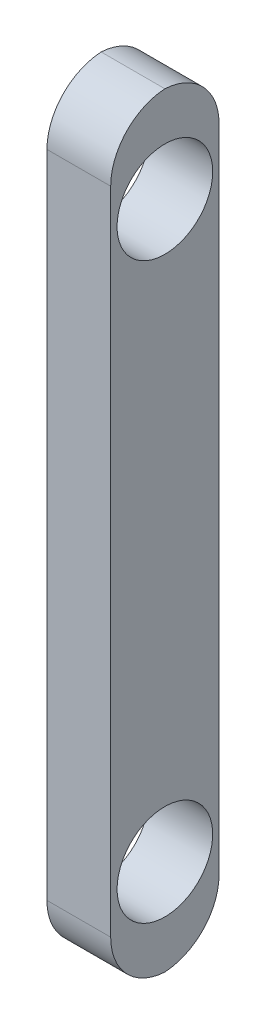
ISO-10303-21;
HEADER;
FILE_DESCRIPTION(('STEP AP214'),'2;1');
FILE_NAME('part.step','',(''),(''),'','','');
FILE_SCHEMA(('AUTOMOTIVE_DESIGN { 1 0 10303 214 1 1 1 1 }'));
ENDSEC;
DATA;
#1=APPLICATION_CONTEXT('core data for automotive mechanical design processes');
#2=APPLICATION_PROTOCOL_DEFINITION('international standard','automotive_design',2000,#1);
#3=PRODUCT_CONTEXT('',#1,'mechanical');
#4=PRODUCT('Part','Part','',(#3));
#5=PRODUCT_RELATED_PRODUCT_CATEGORY('part','',(#4));
#6=PRODUCT_DEFINITION_FORMATION('','',#4);
#7=PRODUCT_DEFINITION_CONTEXT('part definition',#1,'design');
#8=PRODUCT_DEFINITION('design','',#6,#7);
#9=PRODUCT_DEFINITION_SHAPE('','',#8);
#10=(LENGTH_UNIT() NAMED_UNIT(*) SI_UNIT(.MILLI.,.METRE.));
#11=(NAMED_UNIT(*) PLANE_ANGLE_UNIT() SI_UNIT($,.RADIAN.));
#12=(NAMED_UNIT(*) SI_UNIT($,.STERADIAN.) SOLID_ANGLE_UNIT());
#13=UNCERTAINTY_MEASURE_WITH_UNIT(LENGTH_MEASURE(1.E-05),#10,'distance_accuracy_value','');
#14=(GEOMETRIC_REPRESENTATION_CONTEXT(3) GLOBAL_UNCERTAINTY_ASSIGNED_CONTEXT((#13)) GLOBAL_UNIT_ASSIGNED_CONTEXT((#10,
#11,#12)) REPRESENTATION_CONTEXT('',''));
#15=CARTESIAN_POINT('',(0.,0.,0.));
#16=DIRECTION('',(0.,0.,1.));
#17=DIRECTION('',(1.,0.,0.));
#18=AXIS2_PLACEMENT_3D('',#15,#16,#17);
#19=CARTESIAN_POINT('',(2.,0.,-7.10219321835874));
#20=DIRECTION('',(0.,0.,1.));
#21=DIRECTION('',(0.,-1.,0.));
#22=AXIS2_PLACEMENT_3D('',#19,#20,#21);
#23=PLANE('',#22);
#24=DIRECTION('',(0.,1.,0.));
#25=VECTOR('',#24,1.);
#26=CARTESIAN_POINT('',(2.,0.,-7.10219321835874));
#27=LINE('',#26,#25);
#28=CARTESIAN_POINT('',(2.,-22.2,-7.10219321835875));
#29=VERTEX_POINT('',#28);
#30=CARTESIAN_POINT('',(2.,-1.8,-7.10219321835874));
#31=VERTEX_POINT('',#30);
#32=EDGE_CURVE('E118',#29,#31,#27,.T.);
#33=ORIENTED_EDGE('',*,*,#32,.F.);
#34=DIRECTION('',(-1.,0.,0.));
#35=VECTOR('',#34,1.);
#36=CARTESIAN_POINT('',(2.,-22.2,-7.10219321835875));
#37=LINE('',#36,#35);
#38=CARTESIAN_POINT('',(0.,-22.2,-7.10219321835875));
#39=VERTEX_POINT('',#38);
#40=EDGE_CURVE('E105',#29,#39,#37,.T.);
#41=ORIENTED_EDGE('',*,*,#40,.T.);
#42=DIRECTION('',(0.,1.,0.));
#43=VECTOR('',#42,1.);
#44=CARTESIAN_POINT('',(0.,0.,-7.10219321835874));
#45=LINE('',#44,#43);
#46=CARTESIAN_POINT('',(0.,-1.8,-7.10219321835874));
#47=VERTEX_POINT('',#46);
#48=EDGE_CURVE('E116',#39,#47,#45,.T.);
#49=ORIENTED_EDGE('',*,*,#48,.T.);
#50=DIRECTION('',(-1.,0.,0.));
#51=VECTOR('',#50,1.);
#52=CARTESIAN_POINT('',(2.,-1.8,-7.10219321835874));
#53=LINE('',#52,#51);
#54=EDGE_CURVE('E121',#47,#31,#53,.F.);
#55=ORIENTED_EDGE('',*,*,#54,.T.);
#56=EDGE_LOOP('',(#33,#41,#49,#55));
#57=FACE_BOUND('',#56,.T.);
#58=ADVANCED_FACE('F45',(#57),#23,.F.);
#59=CARTESIAN_POINT('',(2.,-24.,-3.70219321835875));
#60=DIRECTION('',(0.,0.,-1.));
#61=DIRECTION('',(-1.,0.,0.));
#62=AXIS2_PLACEMENT_3D('',#59,#60,#61);
#63=PLANE('',#62);
#64=DIRECTION('',(0.,-1.,0.));
#65=VECTOR('',#64,1.);
#66=CARTESIAN_POINT('',(0.,-24.,-3.70219321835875));
#67=LINE('',#66,#65);
#68=CARTESIAN_POINT('',(0.,-1.8,-3.70219321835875));
#69=VERTEX_POINT('',#68);
#70=CARTESIAN_POINT('',(0.,-22.2,-3.70219321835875));
#71=VERTEX_POINT('',#70);
#72=EDGE_CURVE('E126',#69,#71,#67,.T.);
#73=ORIENTED_EDGE('',*,*,#72,.T.);
#74=DIRECTION('',(-1.,0.,0.));
#75=VECTOR('',#74,1.);
#76=CARTESIAN_POINT('',(2.,-22.2,-3.70219321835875));
#77=LINE('',#76,#75);
#78=CARTESIAN_POINT('',(2.,-22.2,-3.70219321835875));
#79=VERTEX_POINT('',#78);
#80=EDGE_CURVE('E11',#71,#79,#77,.F.);
#81=ORIENTED_EDGE('',*,*,#80,.T.);
#82=DIRECTION('',(0.,-1.,0.));
#83=VECTOR('',#82,1.);
#84=CARTESIAN_POINT('',(2.,-24.,-3.70219321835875));
#85=LINE('',#84,#83);
#86=CARTESIAN_POINT('',(2.,-1.8,-3.70219321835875));
#87=VERTEX_POINT('',#86);
#88=EDGE_CURVE('E137',#87,#79,#85,.T.);
#89=ORIENTED_EDGE('',*,*,#88,.F.);
#90=DIRECTION('',(-1.,0.,0.));
#91=VECTOR('',#90,1.);
#92=CARTESIAN_POINT('',(2.,-1.8,-3.70219321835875));
#93=LINE('',#92,#91);
#94=EDGE_CURVE('E55',#87,#69,#93,.T.);
#95=ORIENTED_EDGE('',*,*,#94,.T.);
#96=EDGE_LOOP('',(#73,#81,#89,#95));
#97=FACE_BOUND('',#96,.T.);
#98=ADVANCED_FACE('F189',(#97),#63,.F.);
#99=CARTESIAN_POINT('',(2.,0.,0.));
#100=DIRECTION('',(-1.,0.,0.));
#101=DIRECTION('',(0.,0.,1.));
#102=AXIS2_PLACEMENT_3D('',#99,#100,#101);
#103=PLANE('',#102);
#104=CARTESIAN_POINT('',(2.,-3.,-5.40219321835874));
#105=DIRECTION('',(1.,0.,0.));
#106=DIRECTION('',(0.,0.,-1.));
#107=AXIS2_PLACEMENT_3D('',#104,#105,#106);
#108=CIRCLE('',#107,1.5);
#109=CARTESIAN_POINT('',(2.,-3.,-6.90219321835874));
#110=VERTEX_POINT('',#109);
#111=EDGE_CURVE('E134',#110,#110,#108,.T.);
#112=ORIENTED_EDGE('',*,*,#111,.F.);
#113=EDGE_LOOP('',(#112));
#114=FACE_BOUND('',#113,.T.);
#115=CARTESIAN_POINT('',(2.,-21.,-5.40219321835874));
#116=DIRECTION('',(1.,0.,0.));
#117=DIRECTION('',(0.,0.,1.));
#118=AXIS2_PLACEMENT_3D('',#115,#116,#117);
#119=CIRCLE('',#118,1.5);
#120=CARTESIAN_POINT('',(2.,-21.,-3.90219321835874));
#121=VERTEX_POINT('',#120);
#122=EDGE_CURVE('E166',#121,#121,#119,.T.);
#123=ORIENTED_EDGE('',*,*,#122,.F.);
#124=EDGE_LOOP('',(#123));
#125=FACE_BOUND('',#124,.T.);
#126=CARTESIAN_POINT('',(2.,-22.2,-5.50219321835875));
#127=DIRECTION('',(-1.,0.,0.));
#128=DIRECTION('',(0.,0.,1.));
#129=AXIS2_PLACEMENT_3D('',#126,#127,#128);
#130=CIRCLE('',#129,1.8);
#131=CARTESIAN_POINT('',(2.,-23.9972200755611,-5.40219321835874));
#132=VERTEX_POINT('',#131);
#133=EDGE_CURVE('E63',#79,#132,#130,.F.);
#134=ORIENTED_EDGE('',*,*,#133,.T.);
#135=CARTESIAN_POINT('',(2.,-22.2,-5.30219321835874));
#136=DIRECTION('',(-1.,0.,0.));
#137=DIRECTION('',(0.,0.,1.));
#138=AXIS2_PLACEMENT_3D('',#135,#136,#137);
#139=CIRCLE('',#138,1.8);
#140=EDGE_CURVE('E156',#132,#29,#139,.F.);
#141=ORIENTED_EDGE('',*,*,#140,.T.);
#142=ORIENTED_EDGE('',*,*,#32,.T.);
#143=CARTESIAN_POINT('',(2.,-1.8,-5.30219321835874));
#144=DIRECTION('',(-1.,0.,0.));
#145=DIRECTION('',(0.,0.,1.));
#146=AXIS2_PLACEMENT_3D('',#143,#144,#145);
#147=CIRCLE('',#146,1.8);
#148=CARTESIAN_POINT('',(2.,-0.00277992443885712,-5.40219321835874));
#149=VERTEX_POINT('',#148);
#150=EDGE_CURVE('E70',#31,#149,#147,.F.);
#151=ORIENTED_EDGE('',*,*,#150,.T.);
#152=CARTESIAN_POINT('',(2.,-1.8,-5.50219321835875));
#153=DIRECTION('',(-1.,0.,0.));
#154=DIRECTION('',(0.,0.,1.));
#155=AXIS2_PLACEMENT_3D('',#152,#153,#154);
#156=CIRCLE('',#155,1.8);
#157=EDGE_CURVE('E151',#149,#87,#156,.F.);
#158=ORIENTED_EDGE('',*,*,#157,.T.);
#159=ORIENTED_EDGE('',*,*,#88,.T.);
#160=EDGE_LOOP('',(#134,#141,#142,#151,#158,#159));
#161=FACE_BOUND('',#160,.T.);
#162=ADVANCED_FACE('F174',(#114,#125,#161),#103,.F.);
#163=CARTESIAN_POINT('',(0.,0.,0.));
#164=DIRECTION('',(-1.,0.,0.));
#165=DIRECTION('',(0.,0.,1.));
#166=AXIS2_PLACEMENT_3D('',#163,#164,#165);
#167=PLANE('',#166);
#168=CARTESIAN_POINT('',(0.,-3.,-5.40219321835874));
#169=DIRECTION('',(1.,0.,0.));
#170=DIRECTION('',(0.,0.,-1.));
#171=AXIS2_PLACEMENT_3D('',#168,#169,#170);
#172=CIRCLE('',#171,1.5);
#173=CARTESIAN_POINT('',(0.,-3.,-6.90219321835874));
#174=VERTEX_POINT('',#173);
#175=EDGE_CURVE('E127',#174,#174,#172,.T.);
#176=ORIENTED_EDGE('',*,*,#175,.T.);
#177=EDGE_LOOP('',(#176));
#178=FACE_BOUND('',#177,.T.);
#179=CARTESIAN_POINT('',(0.,-21.,-5.40219321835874));
#180=DIRECTION('',(1.,0.,0.));
#181=DIRECTION('',(0.,0.,1.));
#182=AXIS2_PLACEMENT_3D('',#179,#180,#181);
#183=CIRCLE('',#182,1.5);
#184=CARTESIAN_POINT('',(0.,-21.,-3.90219321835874));
#185=VERTEX_POINT('',#184);
#186=EDGE_CURVE('E162',#185,#185,#183,.T.);
#187=ORIENTED_EDGE('',*,*,#186,.T.);
#188=EDGE_LOOP('',(#187));
#189=FACE_BOUND('',#188,.T.);
#190=ORIENTED_EDGE('',*,*,#48,.F.);
#191=CARTESIAN_POINT('',(0.,-22.2,-5.30219321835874));
#192=DIRECTION('',(-1.,0.,0.));
#193=DIRECTION('',(0.,0.,1.));
#194=AXIS2_PLACEMENT_3D('',#191,#192,#193);
#195=CIRCLE('',#194,1.8);
#196=CARTESIAN_POINT('',(0.,-23.9972200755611,-5.40219321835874));
#197=VERTEX_POINT('',#196);
#198=EDGE_CURVE('E101',#39,#197,#195,.T.);
#199=ORIENTED_EDGE('',*,*,#198,.T.);
#200=CARTESIAN_POINT('',(0.,-22.2,-5.50219321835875));
#201=DIRECTION('',(-1.,0.,0.));
#202=DIRECTION('',(0.,0.,1.));
#203=AXIS2_PLACEMENT_3D('',#200,#201,#202);
#204=CIRCLE('',#203,1.8);
#205=EDGE_CURVE('E111',#197,#71,#204,.T.);
#206=ORIENTED_EDGE('',*,*,#205,.T.);
#207=ORIENTED_EDGE('',*,*,#72,.F.);
#208=CARTESIAN_POINT('',(0.,-1.8,-5.50219321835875));
#209=DIRECTION('',(-1.,0.,0.));
#210=DIRECTION('',(0.,0.,1.));
#211=AXIS2_PLACEMENT_3D('',#208,#209,#210);
#212=CIRCLE('',#211,1.8);
#213=CARTESIAN_POINT('',(0.,-0.00277992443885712,-5.40219321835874));
#214=VERTEX_POINT('',#213);
#215=EDGE_CURVE('E144',#69,#214,#212,.T.);
#216=ORIENTED_EDGE('',*,*,#215,.T.);
#217=CARTESIAN_POINT('',(0.,-1.8,-5.30219321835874));
#218=DIRECTION('',(-1.,0.,0.));
#219=DIRECTION('',(0.,0.,1.));
#220=AXIS2_PLACEMENT_3D('',#217,#218,#219);
#221=CIRCLE('',#220,1.8);
#222=EDGE_CURVE('E120',#214,#47,#221,.T.);
#223=ORIENTED_EDGE('',*,*,#222,.T.);
#224=EDGE_LOOP('',(#190,#199,#206,#207,#216,#223));
#225=FACE_BOUND('',#224,.T.);
#226=ADVANCED_FACE('F123',(#178,#189,#225),#167,.T.);
#227=CARTESIAN_POINT('',(0.,-21.,-5.40219321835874));
#228=DIRECTION('',(1.,0.,0.));
#229=DIRECTION('',(0.,0.,-1.));
#230=AXIS2_PLACEMENT_3D('',#227,#228,#229);
#231=CYLINDRICAL_SURFACE('',#230,1.5);
#232=ORIENTED_EDGE('',*,*,#186,.F.);
#233=EDGE_LOOP('',(#232));
#234=FACE_BOUND('',#233,.T.);
#235=ORIENTED_EDGE('',*,*,#122,.T.);
#236=EDGE_LOOP('',(#235));
#237=FACE_BOUND('',#236,.T.);
#238=ADVANCED_FACE('F193',(#234,#237),#231,.F.);
#239=CARTESIAN_POINT('',(0.,-3.,-5.40219321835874));
#240=DIRECTION('',(1.,0.,0.));
#241=DIRECTION('',(0.,0.,-1.));
#242=AXIS2_PLACEMENT_3D('',#239,#240,#241);
#243=CYLINDRICAL_SURFACE('',#242,1.5);
#244=ORIENTED_EDGE('',*,*,#175,.F.);
#245=EDGE_LOOP('',(#244));
#246=FACE_BOUND('',#245,.T.);
#247=ORIENTED_EDGE('',*,*,#111,.T.);
#248=EDGE_LOOP('',(#247));
#249=FACE_BOUND('',#248,.T.);
#250=ADVANCED_FACE('F185',(#246,#249),#243,.F.);
#251=CARTESIAN_POINT('',(2.,-22.2,-5.50219321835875));
#252=DIRECTION('',(-1.,0.,0.));
#253=DIRECTION('',(0.,0.,1.));
#254=AXIS2_PLACEMENT_3D('',#251,#252,#253);
#255=CYLINDRICAL_SURFACE('',#254,1.8);
#256=DIRECTION('',(-1.,0.,0.));
#257=VECTOR('',#256,1.);
#258=CARTESIAN_POINT('',(1.,-23.9972200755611,-5.40219321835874));
#259=LINE('',#258,#257);
#260=EDGE_CURVE('E106',#132,#197,#259,.T.);
#261=ORIENTED_EDGE('',*,*,#260,.F.);
#262=ORIENTED_EDGE('',*,*,#133,.F.);
#263=ORIENTED_EDGE('',*,*,#80,.F.);
#264=ORIENTED_EDGE('',*,*,#205,.F.);
#265=EDGE_LOOP('',(#261,#262,#263,#264));
#266=FACE_BOUND('',#265,.T.);
#267=ADVANCED_FACE('F200',(#266),#255,.T.);
#268=CARTESIAN_POINT('',(2.,-22.2,-5.30219321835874));
#269=DIRECTION('',(-1.,0.,0.));
#270=DIRECTION('',(0.,0.,1.));
#271=AXIS2_PLACEMENT_3D('',#268,#269,#270);
#272=CYLINDRICAL_SURFACE('',#271,1.8);
#273=ORIENTED_EDGE('',*,*,#140,.F.);
#274=ORIENTED_EDGE('',*,*,#260,.T.);
#275=ORIENTED_EDGE('',*,*,#198,.F.);
#276=ORIENTED_EDGE('',*,*,#40,.F.);
#277=EDGE_LOOP('',(#273,#274,#275,#276));
#278=FACE_BOUND('',#277,.T.);
#279=ADVANCED_FACE('F104',(#278),#272,.T.);
#280=CARTESIAN_POINT('',(2.,-1.8,-5.30219321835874));
#281=DIRECTION('',(-1.,0.,0.));
#282=DIRECTION('',(0.,0.,1.));
#283=AXIS2_PLACEMENT_3D('',#280,#281,#282);
#284=CYLINDRICAL_SURFACE('',#283,1.8);
#285=DIRECTION('',(-1.,0.,0.));
#286=VECTOR('',#285,1.);
#287=CARTESIAN_POINT('',(1.,-0.00277992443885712,-5.40219321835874));
#288=LINE('',#287,#286);
#289=EDGE_CURVE('E49',#149,#214,#288,.T.);
#290=ORIENTED_EDGE('',*,*,#289,.F.);
#291=ORIENTED_EDGE('',*,*,#150,.F.);
#292=ORIENTED_EDGE('',*,*,#54,.F.);
#293=ORIENTED_EDGE('',*,*,#222,.F.);
#294=EDGE_LOOP('',(#290,#291,#292,#293));
#295=FACE_BOUND('',#294,.T.);
#296=ADVANCED_FACE('F47',(#295),#284,.T.);
#297=CARTESIAN_POINT('',(2.,-1.8,-5.50219321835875));
#298=DIRECTION('',(-1.,0.,0.));
#299=DIRECTION('',(0.,0.,1.));
#300=AXIS2_PLACEMENT_3D('',#297,#298,#299);
#301=CYLINDRICAL_SURFACE('',#300,1.8);
#302=ORIENTED_EDGE('',*,*,#157,.F.);
#303=ORIENTED_EDGE('',*,*,#289,.T.);
#304=ORIENTED_EDGE('',*,*,#215,.F.);
#305=ORIENTED_EDGE('',*,*,#94,.F.);
#306=EDGE_LOOP('',(#302,#303,#304,#305));
#307=FACE_BOUND('',#306,.T.);
#308=ADVANCED_FACE('F171',(#307),#301,.T.);
#309=CLOSED_SHELL('',(#58,#98,#162,#226,#238,#250,#267,#279,#296,#308));
#310=MANIFOLD_SOLID_BREP('B2',#309);
#311=ADVANCED_BREP_SHAPE_REPRESENTATION('',(#18,#310),#14);
#312=SHAPE_DEFINITION_REPRESENTATION(#9,#311);
ENDSEC;
END-ISO-10303-21;
